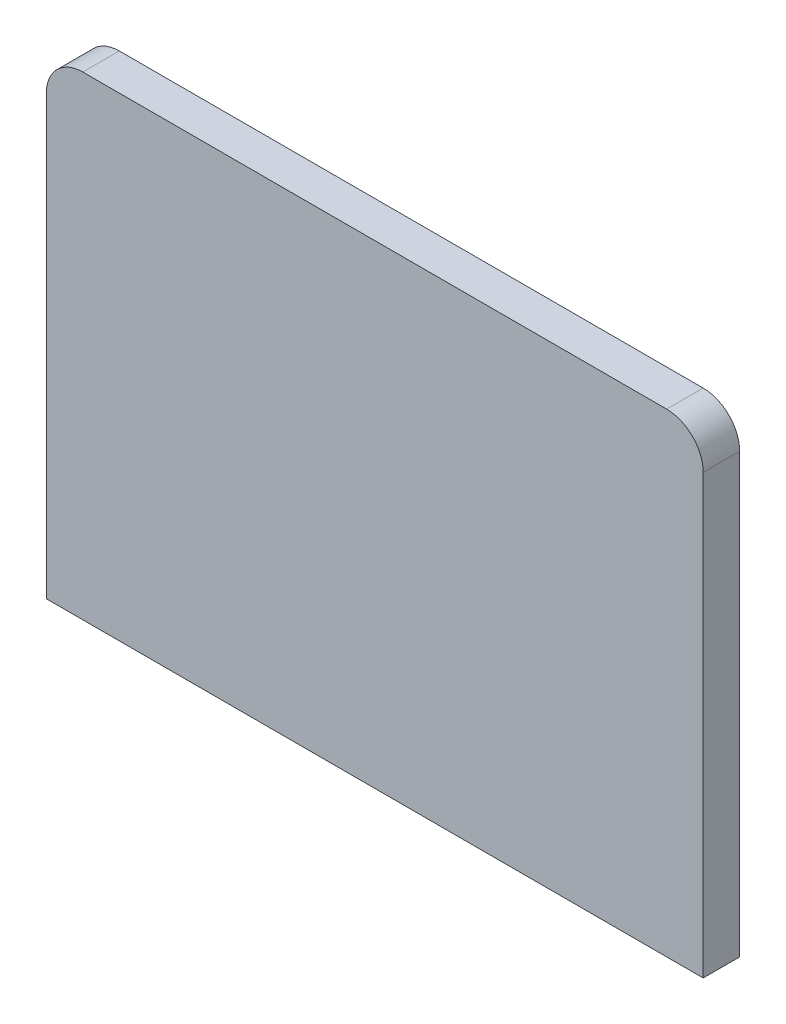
ISO-10303-21;
HEADER;
FILE_DESCRIPTION(('STEP AP214'),'2;1');
FILE_NAME('part.step','',(''),(''),'','','');
FILE_SCHEMA(('AUTOMOTIVE_DESIGN { 1 0 10303 214 1 1 1 1 }'));
ENDSEC;
DATA;
#1=APPLICATION_CONTEXT('core data for automotive mechanical design processes');
#2=APPLICATION_PROTOCOL_DEFINITION('international standard','automotive_design',2000,#1);
#3=PRODUCT_CONTEXT('',#1,'mechanical');
#4=PRODUCT('Part','Part','',(#3));
#5=PRODUCT_RELATED_PRODUCT_CATEGORY('part','',(#4));
#6=PRODUCT_DEFINITION_FORMATION('','',#4);
#7=PRODUCT_DEFINITION_CONTEXT('part definition',#1,'design');
#8=PRODUCT_DEFINITION('design','',#6,#7);
#9=PRODUCT_DEFINITION_SHAPE('','',#8);
#10=(LENGTH_UNIT() NAMED_UNIT(*) SI_UNIT(.MILLI.,.METRE.));
#11=(NAMED_UNIT(*) PLANE_ANGLE_UNIT() SI_UNIT($,.RADIAN.));
#12=(NAMED_UNIT(*) SI_UNIT($,.STERADIAN.) SOLID_ANGLE_UNIT());
#13=UNCERTAINTY_MEASURE_WITH_UNIT(LENGTH_MEASURE(1.E-05),#10,'distance_accuracy_value','');
#14=(GEOMETRIC_REPRESENTATION_CONTEXT(3) GLOBAL_UNCERTAINTY_ASSIGNED_CONTEXT((#13)) GLOBAL_UNIT_ASSIGNED_CONTEXT((#10,
#11,#12)) REPRESENTATION_CONTEXT('',''));
#15=CARTESIAN_POINT('',(0.,0.,0.));
#16=DIRECTION('',(0.,0.,1.));
#17=DIRECTION('',(1.,0.,0.));
#18=AXIS2_PLACEMENT_3D('',#15,#16,#17);
#19=CARTESIAN_POINT('',(45.,40.,5.));
#20=DIRECTION('',(-1.,0.,0.));
#21=DIRECTION('',(0.,-1.,0.));
#22=AXIS2_PLACEMENT_3D('',#19,#20,#21);
#23=PLANE('',#22);
#24=DIRECTION('',(0.,1.,0.));
#25=VECTOR('',#24,1.);
#26=CARTESIAN_POINT('',(45.,40.,0.));
#27=LINE('',#26,#25);
#28=CARTESIAN_POINT('',(45.,40.,0.));
#29=VERTEX_POINT('',#28);
#30=CARTESIAN_POINT('',(45.,100.,0.));
#31=VERTEX_POINT('',#30);
#32=EDGE_CURVE('E121',#29,#31,#27,.T.);
#33=ORIENTED_EDGE('',*,*,#32,.T.);
#34=DIRECTION('',(0.,0.,-1.));
#35=VECTOR('',#34,1.);
#36=CARTESIAN_POINT('',(45.,100.,5.));
#37=LINE('',#36,#35);
#38=CARTESIAN_POINT('',(45.,100.,5.));
#39=VERTEX_POINT('',#38);
#40=EDGE_CURVE('E40',#39,#31,#37,.T.);
#41=ORIENTED_EDGE('',*,*,#40,.F.);
#42=DIRECTION('',(0.,1.,0.));
#43=VECTOR('',#42,1.);
#44=CARTESIAN_POINT('',(45.,40.,5.));
#45=LINE('',#44,#43);
#46=CARTESIAN_POINT('',(45.,40.,5.));
#47=VERTEX_POINT('',#46);
#48=EDGE_CURVE('E87',#47,#39,#45,.T.);
#49=ORIENTED_EDGE('',*,*,#48,.F.);
#50=DIRECTION('',(0.,0.,-1.));
#51=VECTOR('',#50,1.);
#52=CARTESIAN_POINT('',(45.,40.,5.));
#53=LINE('',#52,#51);
#54=EDGE_CURVE('E11',#47,#29,#53,.T.);
#55=ORIENTED_EDGE('',*,*,#54,.T.);
#56=EDGE_LOOP('',(#33,#41,#49,#55));
#57=FACE_BOUND('',#56,.T.);
#58=ADVANCED_FACE('F32',(#57),#23,.F.);
#59=CARTESIAN_POINT('',(40.,100.,5.));
#60=DIRECTION('',(0.,0.,-1.));
#61=DIRECTION('',(-1.,0.,0.));
#62=AXIS2_PLACEMENT_3D('',#59,#60,#61);
#63=CYLINDRICAL_SURFACE('',#62,5.);
#64=CARTESIAN_POINT('',(40.,100.,0.));
#65=DIRECTION('',(0.,0.,1.));
#66=DIRECTION('',(1.,0.,0.));
#67=AXIS2_PLACEMENT_3D('',#64,#65,#66);
#68=CIRCLE('',#67,5.);
#69=CARTESIAN_POINT('',(40.,105.,0.));
#70=VERTEX_POINT('',#69);
#71=EDGE_CURVE('E123',#31,#70,#68,.T.);
#72=ORIENTED_EDGE('',*,*,#71,.T.);
#73=DIRECTION('',(0.,0.,-1.));
#74=VECTOR('',#73,1.);
#75=CARTESIAN_POINT('',(40.,105.,5.));
#76=LINE('',#75,#74);
#77=CARTESIAN_POINT('',(40.,105.,5.));
#78=VERTEX_POINT('',#77);
#79=EDGE_CURVE('E110',#78,#70,#76,.T.);
#80=ORIENTED_EDGE('',*,*,#79,.F.);
#81=CARTESIAN_POINT('',(40.,100.,5.));
#82=DIRECTION('',(0.,0.,1.));
#83=DIRECTION('',(1.,0.,0.));
#84=AXIS2_PLACEMENT_3D('',#81,#82,#83);
#85=CIRCLE('',#84,5.);
#86=EDGE_CURVE('E101',#39,#78,#85,.T.);
#87=ORIENTED_EDGE('',*,*,#86,.F.);
#88=ORIENTED_EDGE('',*,*,#40,.T.);
#89=EDGE_LOOP('',(#72,#80,#87,#88));
#90=FACE_BOUND('',#89,.T.);
#91=ADVANCED_FACE('F135',(#90),#63,.T.);
#92=CARTESIAN_POINT('',(40.,105.,5.));
#93=DIRECTION('',(0.,-1.,0.));
#94=DIRECTION('',(0.,0.,-1.));
#95=AXIS2_PLACEMENT_3D('',#92,#93,#94);
#96=PLANE('',#95);
#97=DIRECTION('',(-1.,0.,0.));
#98=VECTOR('',#97,1.);
#99=CARTESIAN_POINT('',(40.,105.,0.));
#100=LINE('',#99,#98);
#101=CARTESIAN_POINT('',(-40.,105.,0.));
#102=VERTEX_POINT('',#101);
#103=EDGE_CURVE('E109',#70,#102,#100,.T.);
#104=ORIENTED_EDGE('',*,*,#103,.T.);
#105=DIRECTION('',(0.,0.,-1.));
#106=VECTOR('',#105,1.);
#107=CARTESIAN_POINT('',(-40.,105.,5.));
#108=LINE('',#107,#106);
#109=CARTESIAN_POINT('',(-40.,105.,5.));
#110=VERTEX_POINT('',#109);
#111=EDGE_CURVE('E106',#110,#102,#108,.T.);
#112=ORIENTED_EDGE('',*,*,#111,.F.);
#113=DIRECTION('',(-1.,0.,0.));
#114=VECTOR('',#113,1.);
#115=CARTESIAN_POINT('',(40.,105.,5.));
#116=LINE('',#115,#114);
#117=EDGE_CURVE('E95',#78,#110,#116,.T.);
#118=ORIENTED_EDGE('',*,*,#117,.F.);
#119=ORIENTED_EDGE('',*,*,#79,.T.);
#120=EDGE_LOOP('',(#104,#112,#118,#119));
#121=FACE_BOUND('',#120,.T.);
#122=ADVANCED_FACE('F107',(#121),#96,.F.);
#123=CARTESIAN_POINT('',(-40.,100.,5.));
#124=DIRECTION('',(0.,0.,-1.));
#125=DIRECTION('',(-1.,0.,0.));
#126=AXIS2_PLACEMENT_3D('',#123,#124,#125);
#127=CYLINDRICAL_SURFACE('',#126,5.);
#128=CARTESIAN_POINT('',(-40.,100.,0.));
#129=DIRECTION('',(0.,0.,1.));
#130=DIRECTION('',(1.,0.,0.));
#131=AXIS2_PLACEMENT_3D('',#128,#129,#130);
#132=CIRCLE('',#131,5.);
#133=CARTESIAN_POINT('',(-45.,100.,0.));
#134=VERTEX_POINT('',#133);
#135=EDGE_CURVE('E72',#102,#134,#132,.T.);
#136=ORIENTED_EDGE('',*,*,#135,.T.);
#137=DIRECTION('',(0.,0.,-1.));
#138=VECTOR('',#137,1.);
#139=CARTESIAN_POINT('',(-45.,100.,5.));
#140=LINE('',#139,#138);
#141=CARTESIAN_POINT('',(-45.,100.,5.));
#142=VERTEX_POINT('',#141);
#143=EDGE_CURVE('E111',#142,#134,#140,.T.);
#144=ORIENTED_EDGE('',*,*,#143,.F.);
#145=CARTESIAN_POINT('',(-40.,100.,5.));
#146=DIRECTION('',(0.,0.,1.));
#147=DIRECTION('',(1.,0.,0.));
#148=AXIS2_PLACEMENT_3D('',#145,#146,#147);
#149=CIRCLE('',#148,5.);
#150=EDGE_CURVE('E99',#110,#142,#149,.T.);
#151=ORIENTED_EDGE('',*,*,#150,.F.);
#152=ORIENTED_EDGE('',*,*,#111,.T.);
#153=EDGE_LOOP('',(#136,#144,#151,#152));
#154=FACE_BOUND('',#153,.T.);
#155=ADVANCED_FACE('F113',(#154),#127,.T.);
#156=CARTESIAN_POINT('',(-45.,100.,5.));
#157=DIRECTION('',(1.,0.,0.));
#158=DIRECTION('',(0.,0.,-1.));
#159=AXIS2_PLACEMENT_3D('',#156,#157,#158);
#160=PLANE('',#159);
#161=DIRECTION('',(0.,-1.,0.));
#162=VECTOR('',#161,1.);
#163=CARTESIAN_POINT('',(-45.,100.,0.));
#164=LINE('',#163,#162);
#165=CARTESIAN_POINT('',(-45.,40.,0.));
#166=VERTEX_POINT('',#165);
#167=EDGE_CURVE('E127',#134,#166,#164,.T.);
#168=ORIENTED_EDGE('',*,*,#167,.T.);
#169=DIRECTION('',(0.,0.,-1.));
#170=VECTOR('',#169,1.);
#171=CARTESIAN_POINT('',(-45.,40.,5.));
#172=LINE('',#171,#170);
#173=CARTESIAN_POINT('',(-45.,40.,5.));
#174=VERTEX_POINT('',#173);
#175=EDGE_CURVE('E117',#174,#166,#172,.T.);
#176=ORIENTED_EDGE('',*,*,#175,.F.);
#177=DIRECTION('',(0.,-1.,0.));
#178=VECTOR('',#177,1.);
#179=CARTESIAN_POINT('',(-45.,100.,5.));
#180=LINE('',#179,#178);
#181=EDGE_CURVE('E115',#142,#174,#180,.T.);
#182=ORIENTED_EDGE('',*,*,#181,.F.);
#183=ORIENTED_EDGE('',*,*,#143,.T.);
#184=EDGE_LOOP('',(#168,#176,#182,#183));
#185=FACE_BOUND('',#184,.T.);
#186=ADVANCED_FACE('F139',(#185),#160,.F.);
#187=CARTESIAN_POINT('',(-12.5,40.,5.));
#188=DIRECTION('',(0.,1.,0.));
#189=DIRECTION('',(0.,0.,1.));
#190=AXIS2_PLACEMENT_3D('',#187,#188,#189);
#191=PLANE('',#190);
#192=DIRECTION('',(1.,0.,0.));
#193=VECTOR('',#192,1.);
#194=CARTESIAN_POINT('',(-12.5,40.,0.));
#195=LINE('',#194,#193);
#196=EDGE_CURVE('E79',#166,#29,#195,.T.);
#197=ORIENTED_EDGE('',*,*,#196,.T.);
#198=ORIENTED_EDGE('',*,*,#54,.F.);
#199=DIRECTION('',(1.,0.,0.));
#200=VECTOR('',#199,1.);
#201=CARTESIAN_POINT('',(12.5,40.,5.));
#202=LINE('',#201,#200);
#203=EDGE_CURVE('E48',#174,#47,#202,.T.);
#204=ORIENTED_EDGE('',*,*,#203,.F.);
#205=ORIENTED_EDGE('',*,*,#175,.T.);
#206=EDGE_LOOP('',(#197,#198,#204,#205));
#207=FACE_BOUND('',#206,.T.);
#208=ADVANCED_FACE('F140',(#207),#191,.F.);
#209=CARTESIAN_POINT('',(40.,100.,5.));
#210=DIRECTION('',(0.,0.,1.));
#211=DIRECTION('',(1.,0.,0.));
#212=AXIS2_PLACEMENT_3D('',#209,#210,#211);
#213=PLANE('',#212);
#214=ORIENTED_EDGE('',*,*,#203,.T.);
#215=ORIENTED_EDGE('',*,*,#48,.T.);
#216=ORIENTED_EDGE('',*,*,#86,.T.);
#217=ORIENTED_EDGE('',*,*,#117,.T.);
#218=ORIENTED_EDGE('',*,*,#150,.T.);
#219=ORIENTED_EDGE('',*,*,#181,.T.);
#220=EDGE_LOOP('',(#214,#215,#216,#217,#218,#219));
#221=FACE_BOUND('',#220,.T.);
#222=ADVANCED_FACE('F97',(#221),#213,.T.);
#223=CARTESIAN_POINT('',(40.,100.,0.));
#224=DIRECTION('',(0.,0.,1.));
#225=DIRECTION('',(1.,0.,0.));
#226=AXIS2_PLACEMENT_3D('',#223,#224,#225);
#227=PLANE('',#226);
#228=ORIENTED_EDGE('',*,*,#32,.F.);
#229=ORIENTED_EDGE('',*,*,#196,.F.);
#230=ORIENTED_EDGE('',*,*,#167,.F.);
#231=ORIENTED_EDGE('',*,*,#135,.F.);
#232=ORIENTED_EDGE('',*,*,#103,.F.);
#233=ORIENTED_EDGE('',*,*,#71,.F.);
#234=EDGE_LOOP('',(#228,#229,#230,#231,#232,#233));
#235=FACE_BOUND('',#234,.T.);
#236=ADVANCED_FACE('F136',(#235),#227,.F.);
#237=CLOSED_SHELL('',(#58,#91,#122,#155,#186,#208,#222,#236));
#238=MANIFOLD_SOLID_BREP('B2',#237);
#239=ADVANCED_BREP_SHAPE_REPRESENTATION('',(#18,#238),#14);
#240=SHAPE_DEFINITION_REPRESENTATION(#9,#239);
ENDSEC;
END-ISO-10303-21;
